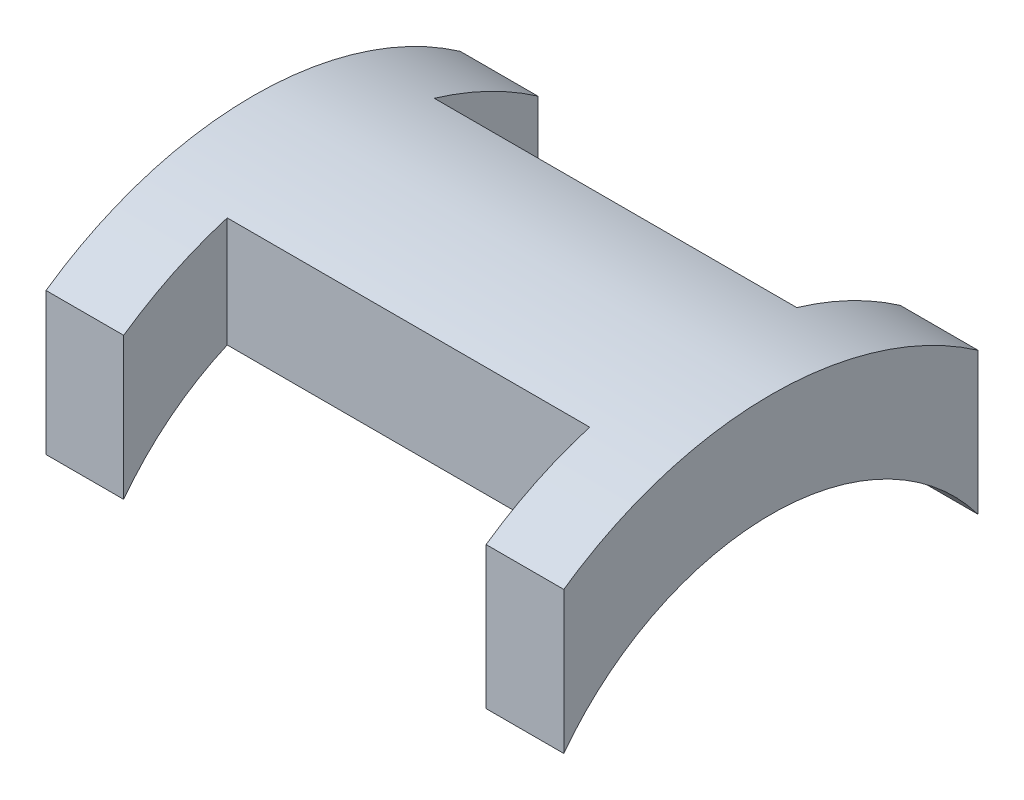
from build123d import *

# Parameters (mm, degrees)
EXTRUDE_1_DEPTH     = 100
SKETCH_2_W          = 70
SKETCH_2_H          = 20
CUT_EXTRUDE_2_DEPTH = 129.452325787


with BuildPart() as part:
    # Sketch 1 → Extrude 1 (new body)
    with BuildSketch(Plane(origin=(0, 0, 0), x_dir=(0, 0, -1), z_dir=(1, 0, 0))):
        with BuildLine():
            Line((-40, 57.445626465), (-40, 30))
            ThreePointArc((-40, 30), (0, 50), (40, 30))
            Line((40, 30), (40, 57.445626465))
            ThreePointArc((40, 57.445626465), (0, 70), (-40, 57.445626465))
        make_face()
    extrude(amount=EXTRUDE_1_DEPTH)

    # Sketch 2 → Cut-Extrude 2 (cut, through all)
    with BuildSketch(Plane(origin=(0, 0, 0), x_dir=(1, 0, 0), z_dir=(0, 1, 0))):
        with Locations((50, 30)):
            Rectangle(SKETCH_2_W, SKETCH_2_H)
        with Locations((50, -30)):
            Rectangle(SKETCH_2_W, SKETCH_2_H)
    extrude(amount=CUT_EXTRUDE_2_DEPTH, mode=Mode.SUBTRACT)


solid = part.part
